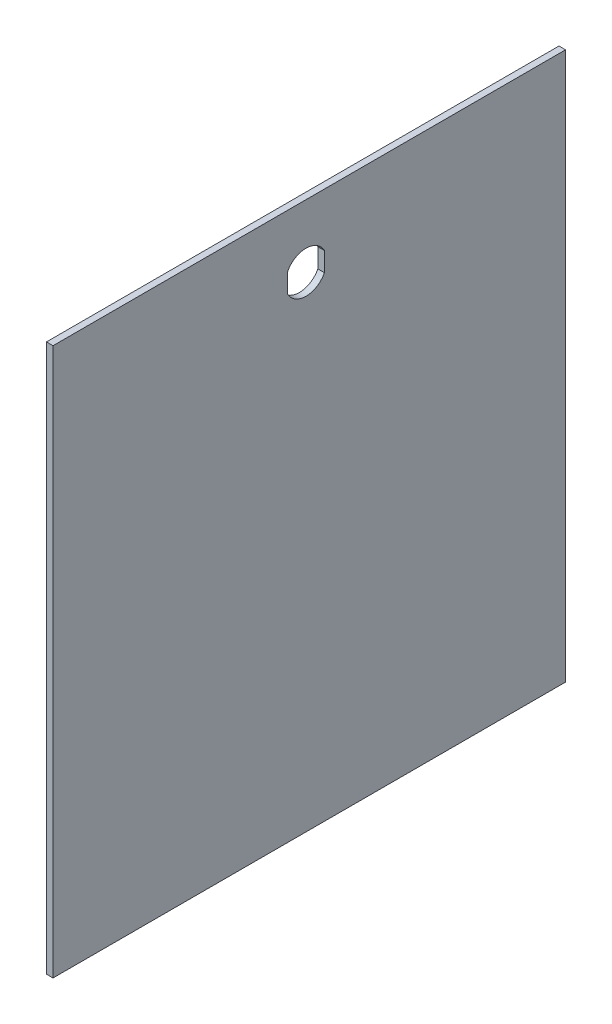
ISO-10303-21;
HEADER;
FILE_DESCRIPTION(('STEP AP214'),'2;1');
FILE_NAME('part.step','',(''),(''),'','','');
FILE_SCHEMA(('AUTOMOTIVE_DESIGN { 1 0 10303 214 1 1 1 1 }'));
ENDSEC;
DATA;
#1=APPLICATION_CONTEXT('core data for automotive mechanical design processes');
#2=APPLICATION_PROTOCOL_DEFINITION('international standard','automotive_design',2000,#1);
#3=PRODUCT_CONTEXT('',#1,'mechanical');
#4=PRODUCT('Part','Part','',(#3));
#5=PRODUCT_RELATED_PRODUCT_CATEGORY('part','',(#4));
#6=PRODUCT_DEFINITION_FORMATION('','',#4);
#7=PRODUCT_DEFINITION_CONTEXT('part definition',#1,'design');
#8=PRODUCT_DEFINITION('design','',#6,#7);
#9=PRODUCT_DEFINITION_SHAPE('','',#8);
#10=(LENGTH_UNIT() NAMED_UNIT(*) SI_UNIT(.MILLI.,.METRE.));
#11=(NAMED_UNIT(*) PLANE_ANGLE_UNIT() SI_UNIT($,.RADIAN.));
#12=(NAMED_UNIT(*) SI_UNIT($,.STERADIAN.) SOLID_ANGLE_UNIT());
#13=UNCERTAINTY_MEASURE_WITH_UNIT(LENGTH_MEASURE(1.E-05),#10,'distance_accuracy_value','');
#14=(GEOMETRIC_REPRESENTATION_CONTEXT(3) GLOBAL_UNCERTAINTY_ASSIGNED_CONTEXT((#13)) GLOBAL_UNIT_ASSIGNED_CONTEXT((#10,
#11,#12)) REPRESENTATION_CONTEXT('',''));
#15=CARTESIAN_POINT('',(0.,0.,0.));
#16=DIRECTION('',(0.,0.,1.));
#17=DIRECTION('',(1.,0.,0.));
#18=AXIS2_PLACEMENT_3D('',#15,#16,#17);
#19=CARTESIAN_POINT('',(-3.,-125.,-117.));
#20=DIRECTION('',(0.,0.,-1.));
#21=DIRECTION('',(-1.,0.,0.));
#22=AXIS2_PLACEMENT_3D('',#19,#20,#21);
#23=PLANE('',#22);
#24=DIRECTION('',(0.,1.,0.));
#25=VECTOR('',#24,1.);
#26=CARTESIAN_POINT('',(0.,-125.,-117.));
#27=LINE('',#26,#25);
#28=CARTESIAN_POINT('',(0.,-125.,-117.));
#29=VERTEX_POINT('',#28);
#30=CARTESIAN_POINT('',(0.,125.,-117.));
#31=VERTEX_POINT('',#30);
#32=EDGE_CURVE('E135',#29,#31,#27,.T.);
#33=ORIENTED_EDGE('',*,*,#32,.F.);
#34=DIRECTION('',(1.,0.,0.));
#35=VECTOR('',#34,1.);
#36=CARTESIAN_POINT('',(-3.,-125.,-117.));
#37=LINE('',#36,#35);
#38=CARTESIAN_POINT('',(-3.,-125.,-117.));
#39=VERTEX_POINT('',#38);
#40=EDGE_CURVE('E11',#39,#29,#37,.T.);
#41=ORIENTED_EDGE('',*,*,#40,.F.);
#42=DIRECTION('',(0.,1.,0.));
#43=VECTOR('',#42,1.);
#44=CARTESIAN_POINT('',(-3.,-125.,-117.));
#45=LINE('',#44,#43);
#46=CARTESIAN_POINT('',(-3.,125.,-117.));
#47=VERTEX_POINT('',#46);
#48=EDGE_CURVE('E139',#39,#47,#45,.T.);
#49=ORIENTED_EDGE('',*,*,#48,.T.);
#50=DIRECTION('',(1.,0.,0.));
#51=VECTOR('',#50,1.);
#52=CARTESIAN_POINT('',(-3.,125.,-117.));
#53=LINE('',#52,#51);
#54=EDGE_CURVE('E40',#47,#31,#53,.T.);
#55=ORIENTED_EDGE('',*,*,#54,.T.);
#56=EDGE_LOOP('',(#33,#41,#49,#55));
#57=FACE_BOUND('',#56,.T.);
#58=ADVANCED_FACE('F37',(#57),#23,.T.);
#59=CARTESIAN_POINT('',(-3.,-125.,117.));
#60=DIRECTION('',(0.,-1.,0.));
#61=DIRECTION('',(0.,0.,-1.));
#62=AXIS2_PLACEMENT_3D('',#59,#60,#61);
#63=PLANE('',#62);
#64=DIRECTION('',(0.,0.,-1.));
#65=VECTOR('',#64,1.);
#66=CARTESIAN_POINT('',(0.,-125.,117.));
#67=LINE('',#66,#65);
#68=CARTESIAN_POINT('',(0.,-125.,117.));
#69=VERTEX_POINT('',#68);
#70=EDGE_CURVE('E143',#69,#29,#67,.T.);
#71=ORIENTED_EDGE('',*,*,#70,.F.);
#72=DIRECTION('',(1.,0.,0.));
#73=VECTOR('',#72,1.);
#74=CARTESIAN_POINT('',(-3.,-125.,117.));
#75=LINE('',#74,#73);
#76=CARTESIAN_POINT('',(-3.,-125.,117.));
#77=VERTEX_POINT('',#76);
#78=EDGE_CURVE('E45',#77,#69,#75,.T.);
#79=ORIENTED_EDGE('',*,*,#78,.F.);
#80=DIRECTION('',(0.,0.,-1.));
#81=VECTOR('',#80,1.);
#82=CARTESIAN_POINT('',(-3.,-125.,117.));
#83=LINE('',#82,#81);
#84=EDGE_CURVE('E149',#77,#39,#83,.T.);
#85=ORIENTED_EDGE('',*,*,#84,.T.);
#86=ORIENTED_EDGE('',*,*,#40,.T.);
#87=EDGE_LOOP('',(#71,#79,#85,#86));
#88=FACE_BOUND('',#87,.T.);
#89=ADVANCED_FACE('F175',(#88),#63,.T.);
#90=CARTESIAN_POINT('',(-3.,-125.,117.));
#91=DIRECTION('',(0.,0.,1.));
#92=DIRECTION('',(1.,0.,0.));
#93=AXIS2_PLACEMENT_3D('',#90,#91,#92);
#94=PLANE('',#93);
#95=DIRECTION('',(0.,-1.,0.));
#96=VECTOR('',#95,1.);
#97=CARTESIAN_POINT('',(0.,-125.,117.));
#98=LINE('',#97,#96);
#99=CARTESIAN_POINT('',(0.,125.,117.));
#100=VERTEX_POINT('',#99);
#101=EDGE_CURVE('E157',#100,#69,#98,.T.);
#102=ORIENTED_EDGE('',*,*,#101,.F.);
#103=DIRECTION('',(1.,0.,0.));
#104=VECTOR('',#103,1.);
#105=CARTESIAN_POINT('',(-3.,125.,117.));
#106=LINE('',#105,#104);
#107=CARTESIAN_POINT('',(-3.,125.,117.));
#108=VERTEX_POINT('',#107);
#109=EDGE_CURVE('E162',#108,#100,#106,.T.);
#110=ORIENTED_EDGE('',*,*,#109,.F.);
#111=DIRECTION('',(0.,-1.,0.));
#112=VECTOR('',#111,1.);
#113=CARTESIAN_POINT('',(-3.,-125.,117.));
#114=LINE('',#113,#112);
#115=EDGE_CURVE('E146',#108,#77,#114,.T.);
#116=ORIENTED_EDGE('',*,*,#115,.T.);
#117=ORIENTED_EDGE('',*,*,#78,.T.);
#118=EDGE_LOOP('',(#102,#110,#116,#117));
#119=FACE_BOUND('',#118,.T.);
#120=ADVANCED_FACE('F179',(#119),#94,.T.);
#121=CARTESIAN_POINT('',(-3.,125.,117.));
#122=DIRECTION('',(0.,1.,0.));
#123=DIRECTION('',(0.,0.,1.));
#124=AXIS2_PLACEMENT_3D('',#121,#122,#123);
#125=PLANE('',#124);
#126=DIRECTION('',(0.,0.,1.));
#127=VECTOR('',#126,1.);
#128=CARTESIAN_POINT('',(0.,125.,117.));
#129=LINE('',#128,#127);
#130=EDGE_CURVE('E154',#31,#100,#129,.T.);
#131=ORIENTED_EDGE('',*,*,#130,.F.);
#132=ORIENTED_EDGE('',*,*,#54,.F.);
#133=DIRECTION('',(0.,0.,1.));
#134=VECTOR('',#133,1.);
#135=CARTESIAN_POINT('',(-3.,125.,117.));
#136=LINE('',#135,#134);
#137=EDGE_CURVE('E142',#47,#108,#136,.T.);
#138=ORIENTED_EDGE('',*,*,#137,.T.);
#139=ORIENTED_EDGE('',*,*,#109,.T.);
#140=EDGE_LOOP('',(#131,#132,#138,#139));
#141=FACE_BOUND('',#140,.T.);
#142=ADVANCED_FACE('F170',(#141),#125,.T.);
#143=CARTESIAN_POINT('',(-3.,0.,0.));
#144=DIRECTION('',(-1.,0.,0.));
#145=DIRECTION('',(0.,0.,1.));
#146=AXIS2_PLACEMENT_3D('',#143,#144,#145);
#147=PLANE('',#146);
#148=CARTESIAN_POINT('',(-3.,96.3,1.5));
#149=DIRECTION('',(1.,0.,0.));
#150=DIRECTION('',(0.,0.,-1.));
#151=AXIS2_PLACEMENT_3D('',#148,#149,#150);
#152=CIRCLE('',#151,9.49999999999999);
#153=CARTESIAN_POINT('',(-3.,100.698389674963,-6.9204612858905));
#154=VERTEX_POINT('',#153);
#155=CARTESIAN_POINT('',(-3.,100.63277418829,9.95441114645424));
#156=VERTEX_POINT('',#155);
#157=EDGE_CURVE('E104',#154,#156,#152,.T.);
#158=ORIENTED_EDGE('',*,*,#157,.T.);
#159=DIRECTION('',(0.,-1.,0.));
#160=VECTOR('',#159,1.);
#161=CARTESIAN_POINT('',(-3.,91.9672258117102,9.95441114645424));
#162=LINE('',#161,#160);
#163=CARTESIAN_POINT('',(-3.,91.9672258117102,9.95441114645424));
#164=VERTEX_POINT('',#163);
#165=EDGE_CURVE('E113',#156,#164,#162,.T.);
#166=ORIENTED_EDGE('',*,*,#165,.T.);
#167=CARTESIAN_POINT('',(-3.,96.3,1.5));
#168=DIRECTION('',(1.,0.,0.));
#169=DIRECTION('',(0.,0.,-1.));
#170=AXIS2_PLACEMENT_3D('',#167,#168,#169);
#171=CIRCLE('',#170,9.49999999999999);
#172=CARTESIAN_POINT('',(-3.,91.9016103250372,-6.9204612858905));
#173=VERTEX_POINT('',#172);
#174=EDGE_CURVE('E53',#164,#173,#171,.T.);
#175=ORIENTED_EDGE('',*,*,#174,.T.);
#176=DIRECTION('',(0.,1.,0.));
#177=VECTOR('',#176,1.);
#178=CARTESIAN_POINT('',(-3.,100.698389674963,-6.9204612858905));
#179=LINE('',#178,#177);
#180=EDGE_CURVE('E110',#173,#154,#179,.T.);
#181=ORIENTED_EDGE('',*,*,#180,.T.);
#182=EDGE_LOOP('',(#158,#166,#175,#181));
#183=FACE_BOUND('',#182,.T.);
#184=ORIENTED_EDGE('',*,*,#48,.F.);
#185=ORIENTED_EDGE('',*,*,#84,.F.);
#186=ORIENTED_EDGE('',*,*,#115,.F.);
#187=ORIENTED_EDGE('',*,*,#137,.F.);
#188=EDGE_LOOP('',(#184,#185,#186,#187));
#189=FACE_BOUND('',#188,.T.);
#190=ADVANCED_FACE('F117',(#183,#189),#147,.T.);
#191=CARTESIAN_POINT('',(0.,0.,0.));
#192=DIRECTION('',(-1.,0.,0.));
#193=DIRECTION('',(0.,0.,1.));
#194=AXIS2_PLACEMENT_3D('',#191,#192,#193);
#195=PLANE('',#194);
#196=DIRECTION('',(0.,-1.,0.));
#197=VECTOR('',#196,1.);
#198=CARTESIAN_POINT('',(0.,91.9672258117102,9.95441114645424));
#199=LINE('',#198,#197);
#200=CARTESIAN_POINT('',(0.,100.63277418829,9.95441114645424));
#201=VERTEX_POINT('',#200);
#202=CARTESIAN_POINT('',(0.,91.9672258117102,9.95441114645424));
#203=VERTEX_POINT('',#202);
#204=EDGE_CURVE('E129',#201,#203,#199,.T.);
#205=ORIENTED_EDGE('',*,*,#204,.F.);
#206=CARTESIAN_POINT('',(0.,96.3,1.5));
#207=DIRECTION('',(1.,0.,0.));
#208=DIRECTION('',(0.,0.,-1.));
#209=AXIS2_PLACEMENT_3D('',#206,#207,#208);
#210=CIRCLE('',#209,9.49999999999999);
#211=CARTESIAN_POINT('',(0.,100.698389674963,-6.9204612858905));
#212=VERTEX_POINT('',#211);
#213=EDGE_CURVE('E61',#212,#201,#210,.T.);
#214=ORIENTED_EDGE('',*,*,#213,.F.);
#215=DIRECTION('',(0.,1.,0.));
#216=VECTOR('',#215,1.);
#217=CARTESIAN_POINT('',(0.,100.698389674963,-6.9204612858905));
#218=LINE('',#217,#216);
#219=CARTESIAN_POINT('',(0.,91.9016103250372,-6.9204612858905));
#220=VERTEX_POINT('',#219);
#221=EDGE_CURVE('E120',#220,#212,#218,.T.);
#222=ORIENTED_EDGE('',*,*,#221,.F.);
#223=CARTESIAN_POINT('',(0.,96.3,1.5));
#224=DIRECTION('',(1.,0.,0.));
#225=DIRECTION('',(0.,0.,-1.));
#226=AXIS2_PLACEMENT_3D('',#223,#224,#225);
#227=CIRCLE('',#226,9.49999999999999);
#228=EDGE_CURVE('E123',#203,#220,#227,.T.);
#229=ORIENTED_EDGE('',*,*,#228,.F.);
#230=EDGE_LOOP('',(#205,#214,#222,#229));
#231=FACE_BOUND('',#230,.T.);
#232=ORIENTED_EDGE('',*,*,#32,.T.);
#233=ORIENTED_EDGE('',*,*,#130,.T.);
#234=ORIENTED_EDGE('',*,*,#101,.T.);
#235=ORIENTED_EDGE('',*,*,#70,.T.);
#236=EDGE_LOOP('',(#232,#233,#234,#235));
#237=FACE_BOUND('',#236,.T.);
#238=ADVANCED_FACE('F172',(#231,#237),#195,.F.);
#239=CARTESIAN_POINT('',(-3.,96.3,1.5));
#240=DIRECTION('',(1.,0.,0.));
#241=DIRECTION('',(0.,0.,-1.));
#242=AXIS2_PLACEMENT_3D('',#239,#240,#241);
#243=CYLINDRICAL_SURFACE('',#242,9.49999999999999);
#244=ORIENTED_EDGE('',*,*,#213,.T.);
#245=DIRECTION('',(1.,0.,0.));
#246=VECTOR('',#245,1.);
#247=CARTESIAN_POINT('',(-3.,100.63277418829,9.95441114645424));
#248=LINE('',#247,#246);
#249=EDGE_CURVE('E100',#156,#201,#248,.T.);
#250=ORIENTED_EDGE('',*,*,#249,.F.);
#251=ORIENTED_EDGE('',*,*,#157,.F.);
#252=DIRECTION('',(1.,0.,0.));
#253=VECTOR('',#252,1.);
#254=CARTESIAN_POINT('',(-3.,100.698389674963,-6.9204612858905));
#255=LINE('',#254,#253);
#256=EDGE_CURVE('E133',#154,#212,#255,.T.);
#257=ORIENTED_EDGE('',*,*,#256,.T.);
#258=EDGE_LOOP('',(#244,#250,#251,#257));
#259=FACE_BOUND('',#258,.T.);
#260=ADVANCED_FACE('F102',(#259),#243,.F.);
#261=CARTESIAN_POINT('',(-3.,100.698389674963,-6.9204612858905));
#262=DIRECTION('',(0.,0.,-1.));
#263=DIRECTION('',(-1.,0.,0.));
#264=AXIS2_PLACEMENT_3D('',#261,#262,#263);
#265=PLANE('',#264);
#266=ORIENTED_EDGE('',*,*,#221,.T.);
#267=ORIENTED_EDGE('',*,*,#256,.F.);
#268=ORIENTED_EDGE('',*,*,#180,.F.);
#269=DIRECTION('',(1.,0.,0.));
#270=VECTOR('',#269,1.);
#271=CARTESIAN_POINT('',(-3.,91.9016103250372,-6.9204612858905));
#272=LINE('',#271,#270);
#273=EDGE_CURVE('E136',#173,#220,#272,.T.);
#274=ORIENTED_EDGE('',*,*,#273,.T.);
#275=EDGE_LOOP('',(#266,#267,#268,#274));
#276=FACE_BOUND('',#275,.T.);
#277=ADVANCED_FACE('F235',(#276),#265,.F.);
#278=CARTESIAN_POINT('',(-3.,96.3,1.5));
#279=DIRECTION('',(1.,0.,0.));
#280=DIRECTION('',(0.,0.,-1.));
#281=AXIS2_PLACEMENT_3D('',#278,#279,#280);
#282=CYLINDRICAL_SURFACE('',#281,9.49999999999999);
#283=ORIENTED_EDGE('',*,*,#228,.T.);
#284=ORIENTED_EDGE('',*,*,#273,.F.);
#285=ORIENTED_EDGE('',*,*,#174,.F.);
#286=DIRECTION('',(1.,0.,0.));
#287=VECTOR('',#286,1.);
#288=CARTESIAN_POINT('',(-3.,91.9672258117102,9.95441114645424));
#289=LINE('',#288,#287);
#290=EDGE_CURVE('E109',#164,#203,#289,.T.);
#291=ORIENTED_EDGE('',*,*,#290,.T.);
#292=EDGE_LOOP('',(#283,#284,#285,#291));
#293=FACE_BOUND('',#292,.T.);
#294=ADVANCED_FACE('F245',(#293),#282,.F.);
#295=CARTESIAN_POINT('',(-3.,91.9672258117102,9.95441114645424));
#296=DIRECTION('',(0.,0.,1.));
#297=DIRECTION('',(0.,-1.,0.));
#298=AXIS2_PLACEMENT_3D('',#295,#296,#297);
#299=PLANE('',#298);
#300=ORIENTED_EDGE('',*,*,#204,.T.);
#301=ORIENTED_EDGE('',*,*,#290,.F.);
#302=ORIENTED_EDGE('',*,*,#165,.F.);
#303=ORIENTED_EDGE('',*,*,#249,.T.);
#304=EDGE_LOOP('',(#300,#301,#302,#303));
#305=FACE_BOUND('',#304,.T.);
#306=ADVANCED_FACE('F114',(#305),#299,.F.);
#307=CLOSED_SHELL('',(#58,#89,#120,#142,#190,#238,#260,#277,#294,#306));
#308=MANIFOLD_SOLID_BREP('B2',#307);
#309=ADVANCED_BREP_SHAPE_REPRESENTATION('',(#18,#308),#14);
#310=SHAPE_DEFINITION_REPRESENTATION(#9,#309);
ENDSEC;
END-ISO-10303-21;
